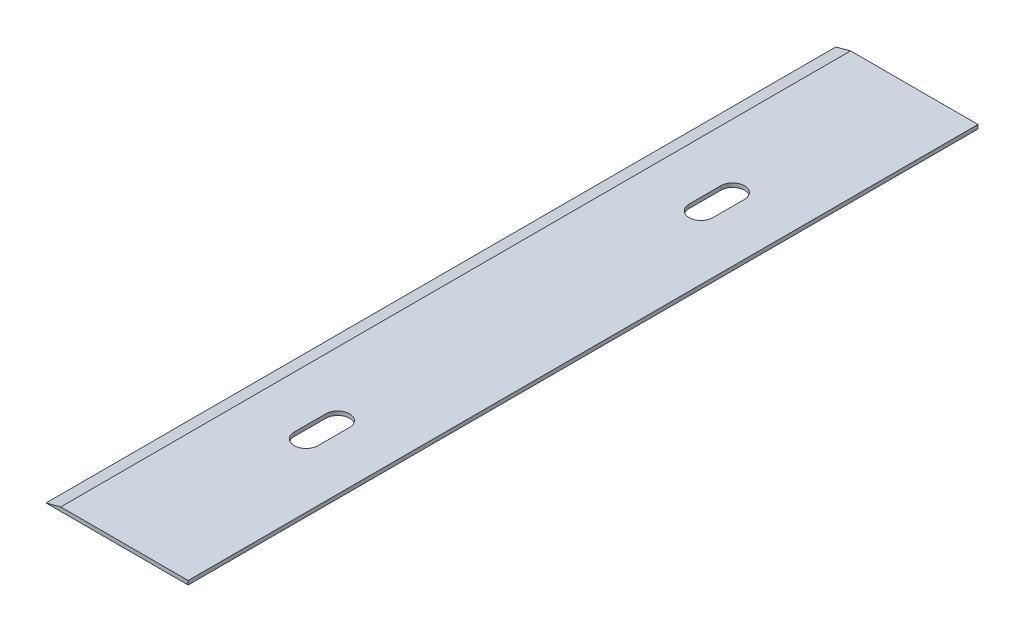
ISO-10303-21;
HEADER;
FILE_DESCRIPTION(('STEP AP214'),'2;1');
FILE_NAME('part.step','',(''),(''),'','','');
FILE_SCHEMA(('AUTOMOTIVE_DESIGN { 1 0 10303 214 1 1 1 1 }'));
ENDSEC;
DATA;
#1=APPLICATION_CONTEXT('core data for automotive mechanical design processes');
#2=APPLICATION_PROTOCOL_DEFINITION('international standard','automotive_design',2000,#1);
#3=PRODUCT_CONTEXT('',#1,'mechanical');
#4=PRODUCT('Part','Part','',(#3));
#5=PRODUCT_RELATED_PRODUCT_CATEGORY('part','',(#4));
#6=PRODUCT_DEFINITION_FORMATION('','',#4);
#7=PRODUCT_DEFINITION_CONTEXT('part definition',#1,'design');
#8=PRODUCT_DEFINITION('design','',#6,#7);
#9=PRODUCT_DEFINITION_SHAPE('','',#8);
#10=(LENGTH_UNIT() NAMED_UNIT(*) SI_UNIT(.MILLI.,.METRE.));
#11=(NAMED_UNIT(*) PLANE_ANGLE_UNIT() SI_UNIT($,.RADIAN.));
#12=(NAMED_UNIT(*) SI_UNIT($,.STERADIAN.) SOLID_ANGLE_UNIT());
#13=UNCERTAINTY_MEASURE_WITH_UNIT(LENGTH_MEASURE(1.E-05),#10,'distance_accuracy_value','');
#14=(GEOMETRIC_REPRESENTATION_CONTEXT(3) GLOBAL_UNCERTAINTY_ASSIGNED_CONTEXT((#13)) GLOBAL_UNIT_ASSIGNED_CONTEXT((#10,
#11,#12)) REPRESENTATION_CONTEXT('',''));
#15=CARTESIAN_POINT('',(0.,0.,0.));
#16=DIRECTION('',(0.,0.,1.));
#17=DIRECTION('',(1.,0.,0.));
#18=AXIS2_PLACEMENT_3D('',#15,#16,#17);
#19=CARTESIAN_POINT('',(18.,0.,-100.));
#20=DIRECTION('',(0.,-1.,0.));
#21=DIRECTION('',(1.,0.,0.));
#22=AXIS2_PLACEMENT_3D('',#19,#20,#21);
#23=PLANE('',#22);
#24=CARTESIAN_POINT('',(9.93301270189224,0.,-77.));
#25=DIRECTION('',(0.,1.,0.));
#26=DIRECTION('',(-1.,0.,0.));
#27=AXIS2_PLACEMENT_3D('',#24,#25,#26);
#28=CIRCLE('',#27,1.5);
#29=CARTESIAN_POINT('',(11.4330127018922,0.,-77.));
#30=VERTEX_POINT('',#29);
#31=CARTESIAN_POINT('',(8.43301270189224,0.,-77.));
#32=VERTEX_POINT('',#31);
#33=EDGE_CURVE('E183',#30,#32,#28,.T.);
#34=ORIENTED_EDGE('',*,*,#33,.T.);
#35=DIRECTION('',(0.,0.,1.));
#36=VECTOR('',#35,1.);
#37=CARTESIAN_POINT('',(8.43301270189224,0.,-77.));
#38=LINE('',#37,#36);
#39=CARTESIAN_POINT('',(8.43301270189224,0.,-73.));
#40=VERTEX_POINT('',#39);
#41=EDGE_CURVE('E187',#32,#40,#38,.T.);
#42=ORIENTED_EDGE('',*,*,#41,.T.);
#43=CARTESIAN_POINT('',(9.93301270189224,0.,-73.));
#44=DIRECTION('',(0.,1.,0.));
#45=DIRECTION('',(-1.,0.,0.));
#46=AXIS2_PLACEMENT_3D('',#43,#44,#45);
#47=CIRCLE('',#46,1.5);
#48=CARTESIAN_POINT('',(11.4330127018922,0.,-73.));
#49=VERTEX_POINT('',#48);
#50=EDGE_CURVE('E192',#40,#49,#47,.T.);
#51=ORIENTED_EDGE('',*,*,#50,.T.);
#52=DIRECTION('',(0.,0.,-1.));
#53=VECTOR('',#52,1.);
#54=CARTESIAN_POINT('',(11.4330127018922,0.,-77.));
#55=LINE('',#54,#53);
#56=EDGE_CURVE('E196',#49,#30,#55,.T.);
#57=ORIENTED_EDGE('',*,*,#56,.T.);
#58=EDGE_LOOP('',(#34,#42,#51,#57));
#59=FACE_BOUND('',#58,.T.);
#60=DIRECTION('',(1.,0.,0.));
#61=VECTOR('',#60,1.);
#62=CARTESIAN_POINT('',(18.,0.,0.));
#63=LINE('',#62,#61);
#64=CARTESIAN_POINT('',(0.,0.,0.));
#65=VERTEX_POINT('',#64);
#66=CARTESIAN_POINT('',(18.,0.,0.));
#67=VERTEX_POINT('',#66);
#68=EDGE_CURVE('E217',#65,#67,#63,.T.);
#69=ORIENTED_EDGE('',*,*,#68,.F.);
#70=DIRECTION('',(0.,0.,1.));
#71=VECTOR('',#70,1.);
#72=CARTESIAN_POINT('',(0.,0.,-100.));
#73=LINE('',#72,#71);
#74=CARTESIAN_POINT('',(0.,0.,-100.));
#75=VERTEX_POINT('',#74);
#76=EDGE_CURVE('E11',#75,#65,#73,.T.);
#77=ORIENTED_EDGE('',*,*,#76,.F.);
#78=DIRECTION('',(1.,0.,0.));
#79=VECTOR('',#78,1.);
#80=CARTESIAN_POINT('',(18.,0.,-100.));
#81=LINE('',#80,#79);
#82=CARTESIAN_POINT('',(18.,0.,-100.));
#83=VERTEX_POINT('',#82);
#84=EDGE_CURVE('E227',#75,#83,#81,.T.);
#85=ORIENTED_EDGE('',*,*,#84,.T.);
#86=DIRECTION('',(0.,0.,1.));
#87=VECTOR('',#86,1.);
#88=CARTESIAN_POINT('',(18.,0.,-100.));
#89=LINE('',#88,#87);
#90=EDGE_CURVE('E50',#83,#67,#89,.T.);
#91=ORIENTED_EDGE('',*,*,#90,.T.);
#92=EDGE_LOOP('',(#69,#77,#85,#91));
#93=FACE_BOUND('',#92,.T.);
#94=DIRECTION('',(0.,0.,-1.));
#95=VECTOR('',#94,1.);
#96=CARTESIAN_POINT('',(8.43301270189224,0.,-23.));
#97=LINE('',#96,#95);
#98=CARTESIAN_POINT('',(8.43301270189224,0.,-23.));
#99=VERTEX_POINT('',#98);
#100=CARTESIAN_POINT('',(8.43301270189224,0.,-27.));
#101=VERTEX_POINT('',#100);
#102=EDGE_CURVE('E151',#99,#101,#97,.T.);
#103=ORIENTED_EDGE('',*,*,#102,.F.);
#104=CARTESIAN_POINT('',(9.93301270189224,0.,-23.));
#105=DIRECTION('',(0.,-1.,0.));
#106=DIRECTION('',(-1.,0.,0.));
#107=AXIS2_PLACEMENT_3D('',#104,#105,#106);
#108=CIRCLE('',#107,1.5);
#109=CARTESIAN_POINT('',(11.4330127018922,0.,-23.));
#110=VERTEX_POINT('',#109);
#111=EDGE_CURVE('E146',#110,#99,#108,.T.);
#112=ORIENTED_EDGE('',*,*,#111,.F.);
#113=DIRECTION('',(0.,0.,1.));
#114=VECTOR('',#113,1.);
#115=CARTESIAN_POINT('',(11.4330127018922,0.,-23.));
#116=LINE('',#115,#114);
#117=CARTESIAN_POINT('',(11.4330127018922,0.,-27.));
#118=VERTEX_POINT('',#117);
#119=EDGE_CURVE('E137',#118,#110,#116,.T.);
#120=ORIENTED_EDGE('',*,*,#119,.F.);
#121=CARTESIAN_POINT('',(9.93301270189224,0.,-27.));
#122=DIRECTION('',(0.,-1.,0.));
#123=DIRECTION('',(-1.,0.,0.));
#124=AXIS2_PLACEMENT_3D('',#121,#122,#123);
#125=CIRCLE('',#124,1.5);
#126=EDGE_CURVE('E145',#101,#118,#125,.T.);
#127=ORIENTED_EDGE('',*,*,#126,.F.);
#128=EDGE_LOOP('',(#103,#112,#120,#127));
#129=FACE_BOUND('',#128,.T.);
#130=ADVANCED_FACE('F47',(#59,#93,#129),#23,.T.);
#131=CARTESIAN_POINT('',(1.86602540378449,0.5,-100.));
#132=DIRECTION('',(0.,1.,0.));
#133=DIRECTION('',(-1.,0.,0.));
#134=AXIS2_PLACEMENT_3D('',#131,#132,#133);
#135=PLANE('',#134);
#136=CARTESIAN_POINT('',(9.93301270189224,0.500000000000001,-77.));
#137=DIRECTION('',(0.,1.,0.));
#138=DIRECTION('',(-1.,0.,0.));
#139=AXIS2_PLACEMENT_3D('',#136,#137,#138);
#140=CIRCLE('',#139,1.5);
#141=CARTESIAN_POINT('',(11.4330127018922,0.500000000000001,-77.));
#142=VERTEX_POINT('',#141);
#143=CARTESIAN_POINT('',(8.43301270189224,0.500000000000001,-77.));
#144=VERTEX_POINT('',#143);
#145=EDGE_CURVE('E177',#142,#144,#140,.T.);
#146=ORIENTED_EDGE('',*,*,#145,.F.);
#147=DIRECTION('',(0.,0.,-1.));
#148=VECTOR('',#147,1.);
#149=CARTESIAN_POINT('',(11.4330127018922,0.500000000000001,-77.));
#150=LINE('',#149,#148);
#151=CARTESIAN_POINT('',(11.4330127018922,0.500000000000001,-73.));
#152=VERTEX_POINT('',#151);
#153=EDGE_CURVE('E188',#152,#142,#150,.T.);
#154=ORIENTED_EDGE('',*,*,#153,.F.);
#155=CARTESIAN_POINT('',(9.93301270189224,0.500000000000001,-73.));
#156=DIRECTION('',(0.,1.,0.));
#157=DIRECTION('',(-1.,0.,0.));
#158=AXIS2_PLACEMENT_3D('',#155,#156,#157);
#159=CIRCLE('',#158,1.5);
#160=CARTESIAN_POINT('',(8.43301270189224,0.500000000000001,-73.));
#161=VERTEX_POINT('',#160);
#162=EDGE_CURVE('E207',#161,#152,#159,.T.);
#163=ORIENTED_EDGE('',*,*,#162,.F.);
#164=DIRECTION('',(0.,0.,1.));
#165=VECTOR('',#164,1.);
#166=CARTESIAN_POINT('',(8.43301270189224,0.500000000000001,-77.));
#167=LINE('',#166,#165);
#168=EDGE_CURVE('E203',#144,#161,#167,.T.);
#169=ORIENTED_EDGE('',*,*,#168,.F.);
#170=EDGE_LOOP('',(#146,#154,#163,#169));
#171=FACE_BOUND('',#170,.T.);
#172=DIRECTION('',(-1.,0.,0.));
#173=VECTOR('',#172,1.);
#174=CARTESIAN_POINT('',(1.86602540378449,0.5,0.));
#175=LINE('',#174,#173);
#176=CARTESIAN_POINT('',(18.,0.500000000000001,0.));
#177=VERTEX_POINT('',#176);
#178=CARTESIAN_POINT('',(1.86602540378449,0.5,0.));
#179=VERTEX_POINT('',#178);
#180=EDGE_CURVE('E251',#177,#179,#175,.T.);
#181=ORIENTED_EDGE('',*,*,#180,.F.);
#182=DIRECTION('',(0.,0.,1.));
#183=VECTOR('',#182,1.);
#184=CARTESIAN_POINT('',(18.,0.500000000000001,-100.));
#185=LINE('',#184,#183);
#186=CARTESIAN_POINT('',(18.,0.500000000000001,-100.));
#187=VERTEX_POINT('',#186);
#188=EDGE_CURVE('E259',#187,#177,#185,.T.);
#189=ORIENTED_EDGE('',*,*,#188,.F.);
#190=DIRECTION('',(-1.,0.,0.));
#191=VECTOR('',#190,1.);
#192=CARTESIAN_POINT('',(1.86602540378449,0.5,-100.));
#193=LINE('',#192,#191);
#194=CARTESIAN_POINT('',(1.86602540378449,0.5,-100.));
#195=VERTEX_POINT('',#194);
#196=EDGE_CURVE('E236',#187,#195,#193,.T.);
#197=ORIENTED_EDGE('',*,*,#196,.T.);
#198=DIRECTION('',(0.,0.,1.));
#199=VECTOR('',#198,1.);
#200=CARTESIAN_POINT('',(1.86602540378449,0.5,-100.));
#201=LINE('',#200,#199);
#202=EDGE_CURVE('E56',#195,#179,#201,.T.);
#203=ORIENTED_EDGE('',*,*,#202,.T.);
#204=EDGE_LOOP('',(#181,#189,#197,#203));
#205=FACE_BOUND('',#204,.T.);
#206=DIRECTION('',(0.,0.,1.));
#207=VECTOR('',#206,1.);
#208=CARTESIAN_POINT('',(11.4330127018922,0.500000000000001,-23.));
#209=LINE('',#208,#207);
#210=CARTESIAN_POINT('',(11.4330127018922,0.500000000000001,-27.));
#211=VERTEX_POINT('',#210);
#212=CARTESIAN_POINT('',(11.4330127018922,0.500000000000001,-23.));
#213=VERTEX_POINT('',#212);
#214=EDGE_CURVE('E168',#211,#213,#209,.T.);
#215=ORIENTED_EDGE('',*,*,#214,.T.);
#216=CARTESIAN_POINT('',(9.93301270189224,0.500000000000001,-23.));
#217=DIRECTION('',(0.,-1.,0.));
#218=DIRECTION('',(-1.,0.,0.));
#219=AXIS2_PLACEMENT_3D('',#216,#217,#218);
#220=CIRCLE('',#219,1.5);
#221=CARTESIAN_POINT('',(8.43301270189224,0.500000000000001,-23.));
#222=VERTEX_POINT('',#221);
#223=EDGE_CURVE('E72',#213,#222,#220,.T.);
#224=ORIENTED_EDGE('',*,*,#223,.T.);
#225=DIRECTION('',(0.,0.,-1.));
#226=VECTOR('',#225,1.);
#227=CARTESIAN_POINT('',(8.43301270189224,0.500000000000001,-23.));
#228=LINE('',#227,#226);
#229=CARTESIAN_POINT('',(8.43301270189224,0.500000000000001,-27.));
#230=VERTEX_POINT('',#229);
#231=EDGE_CURVE('E155',#222,#230,#228,.T.);
#232=ORIENTED_EDGE('',*,*,#231,.T.);
#233=CARTESIAN_POINT('',(9.93301270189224,0.500000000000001,-27.));
#234=DIRECTION('',(0.,-1.,0.));
#235=DIRECTION('',(-1.,0.,0.));
#236=AXIS2_PLACEMENT_3D('',#233,#234,#235);
#237=CIRCLE('',#236,1.5);
#238=EDGE_CURVE('E159',#230,#211,#237,.T.);
#239=ORIENTED_EDGE('',*,*,#238,.T.);
#240=EDGE_LOOP('',(#215,#224,#232,#239));
#241=FACE_BOUND('',#240,.T.);
#242=ADVANCED_FACE('F280',(#171,#205,#241),#135,.T.);
#243=CARTESIAN_POINT('',(0.,0.,-100.));
#244=DIRECTION('',(-0.258819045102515,0.96592582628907,0.));
#245=DIRECTION('',(-0.96592582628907,-0.258819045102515,0.));
#246=AXIS2_PLACEMENT_3D('',#243,#244,#245);
#247=PLANE('',#246);
#248=DIRECTION('',(-0.96592582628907,-0.258819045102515,0.));
#249=VECTOR('',#248,1.);
#250=CARTESIAN_POINT('',(0.,0.,0.));
#251=LINE('',#250,#249);
#252=EDGE_CURVE('E232',#179,#65,#251,.T.);
#253=ORIENTED_EDGE('',*,*,#252,.F.);
#254=ORIENTED_EDGE('',*,*,#202,.F.);
#255=DIRECTION('',(-0.96592582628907,-0.258819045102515,0.));
#256=VECTOR('',#255,1.);
#257=CARTESIAN_POINT('',(0.,0.,-100.));
#258=LINE('',#257,#256);
#259=EDGE_CURVE('E240',#195,#75,#258,.T.);
#260=ORIENTED_EDGE('',*,*,#259,.T.);
#261=ORIENTED_EDGE('',*,*,#76,.T.);
#262=EDGE_LOOP('',(#253,#254,#260,#261));
#263=FACE_BOUND('',#262,.T.);
#264=ADVANCED_FACE('F274',(#263),#247,.T.);
#265=CARTESIAN_POINT('',(18.,0.500000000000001,-100.));
#266=DIRECTION('',(1.,0.,0.));
#267=DIRECTION('',(0.,0.,-1.));
#268=AXIS2_PLACEMENT_3D('',#265,#266,#267);
#269=PLANE('',#268);
#270=DIRECTION('',(0.,1.,0.));
#271=VECTOR('',#270,1.);
#272=CARTESIAN_POINT('',(18.,0.500000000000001,0.));
#273=LINE('',#272,#271);
#274=EDGE_CURVE('E247',#67,#177,#273,.T.);
#275=ORIENTED_EDGE('',*,*,#274,.F.);
#276=ORIENTED_EDGE('',*,*,#90,.F.);
#277=DIRECTION('',(0.,1.,0.));
#278=VECTOR('',#277,1.);
#279=CARTESIAN_POINT('',(18.,0.500000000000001,-100.));
#280=LINE('',#279,#278);
#281=EDGE_CURVE('E231',#83,#187,#280,.T.);
#282=ORIENTED_EDGE('',*,*,#281,.T.);
#283=ORIENTED_EDGE('',*,*,#188,.T.);
#284=EDGE_LOOP('',(#275,#276,#282,#283));
#285=FACE_BOUND('',#284,.T.);
#286=ADVANCED_FACE('F269',(#285),#269,.T.);
#287=CARTESIAN_POINT('',(0.,0.,-100.));
#288=DIRECTION('',(0.,0.,1.));
#289=DIRECTION('',(1.,0.,0.));
#290=AXIS2_PLACEMENT_3D('',#287,#288,#289);
#291=PLANE('',#290);
#292=ORIENTED_EDGE('',*,*,#84,.F.);
#293=ORIENTED_EDGE('',*,*,#259,.F.);
#294=ORIENTED_EDGE('',*,*,#196,.F.);
#295=ORIENTED_EDGE('',*,*,#281,.F.);
#296=EDGE_LOOP('',(#292,#293,#294,#295));
#297=FACE_BOUND('',#296,.T.);
#298=ADVANCED_FACE('F277',(#297),#291,.F.);
#299=CARTESIAN_POINT('',(0.,0.,0.));
#300=DIRECTION('',(0.,0.,1.));
#301=DIRECTION('',(1.,0.,0.));
#302=AXIS2_PLACEMENT_3D('',#299,#300,#301);
#303=PLANE('',#302);
#304=ORIENTED_EDGE('',*,*,#68,.T.);
#305=ORIENTED_EDGE('',*,*,#274,.T.);
#306=ORIENTED_EDGE('',*,*,#180,.T.);
#307=ORIENTED_EDGE('',*,*,#252,.T.);
#308=EDGE_LOOP('',(#304,#305,#306,#307));
#309=FACE_BOUND('',#308,.T.);
#310=ADVANCED_FACE('F271',(#309),#303,.T.);
#311=CARTESIAN_POINT('',(9.93301270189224,0.,-77.));
#312=DIRECTION('',(0.,1.,0.));
#313=DIRECTION('',(-1.,0.,0.));
#314=AXIS2_PLACEMENT_3D('',#311,#312,#313);
#315=CYLINDRICAL_SURFACE('',#314,1.5);
#316=ORIENTED_EDGE('',*,*,#145,.T.);
#317=DIRECTION('',(0.,1.,0.));
#318=VECTOR('',#317,1.);
#319=CARTESIAN_POINT('',(8.43301270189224,0.,-77.));
#320=LINE('',#319,#318);
#321=EDGE_CURVE('E200',#32,#144,#320,.T.);
#322=ORIENTED_EDGE('',*,*,#321,.F.);
#323=ORIENTED_EDGE('',*,*,#33,.F.);
#324=DIRECTION('',(0.,1.,0.));
#325=VECTOR('',#324,1.);
#326=CARTESIAN_POINT('',(11.4330127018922,0.,-77.));
#327=LINE('',#326,#325);
#328=EDGE_CURVE('E214',#30,#142,#327,.T.);
#329=ORIENTED_EDGE('',*,*,#328,.T.);
#330=EDGE_LOOP('',(#316,#322,#323,#329));
#331=FACE_BOUND('',#330,.T.);
#332=ADVANCED_FACE('F309',(#331),#315,.F.);
#333=CARTESIAN_POINT('',(11.4330127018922,0.,-77.));
#334=DIRECTION('',(1.,0.,0.));
#335=DIRECTION('',(0.,1.,0.));
#336=AXIS2_PLACEMENT_3D('',#333,#334,#335);
#337=PLANE('',#336);
#338=ORIENTED_EDGE('',*,*,#153,.T.);
#339=ORIENTED_EDGE('',*,*,#328,.F.);
#340=ORIENTED_EDGE('',*,*,#56,.F.);
#341=DIRECTION('',(0.,1.,0.));
#342=VECTOR('',#341,1.);
#343=CARTESIAN_POINT('',(11.4330127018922,0.,-73.));
#344=LINE('',#343,#342);
#345=EDGE_CURVE('E218',#49,#152,#344,.T.);
#346=ORIENTED_EDGE('',*,*,#345,.T.);
#347=EDGE_LOOP('',(#338,#339,#340,#346));
#348=FACE_BOUND('',#347,.T.);
#349=ADVANCED_FACE('F319',(#348),#337,.F.);
#350=CARTESIAN_POINT('',(9.93301270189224,0.,-73.));
#351=DIRECTION('',(0.,1.,0.));
#352=DIRECTION('',(-1.,0.,0.));
#353=AXIS2_PLACEMENT_3D('',#350,#351,#352);
#354=CYLINDRICAL_SURFACE('',#353,1.5);
#355=ORIENTED_EDGE('',*,*,#162,.T.);
#356=ORIENTED_EDGE('',*,*,#345,.F.);
#357=ORIENTED_EDGE('',*,*,#50,.F.);
#358=DIRECTION('',(0.,1.,0.));
#359=VECTOR('',#358,1.);
#360=CARTESIAN_POINT('',(8.43301270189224,0.,-73.));
#361=LINE('',#360,#359);
#362=EDGE_CURVE('E221',#40,#161,#361,.T.);
#363=ORIENTED_EDGE('',*,*,#362,.T.);
#364=EDGE_LOOP('',(#355,#356,#357,#363));
#365=FACE_BOUND('',#364,.T.);
#366=ADVANCED_FACE('F316',(#365),#354,.F.);
#367=CARTESIAN_POINT('',(8.43301270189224,0.,-77.));
#368=DIRECTION('',(-1.,0.,0.));
#369=DIRECTION('',(0.,-1.,0.));
#370=AXIS2_PLACEMENT_3D('',#367,#368,#369);
#371=PLANE('',#370);
#372=ORIENTED_EDGE('',*,*,#168,.T.);
#373=ORIENTED_EDGE('',*,*,#362,.F.);
#374=ORIENTED_EDGE('',*,*,#41,.F.);
#375=ORIENTED_EDGE('',*,*,#321,.T.);
#376=EDGE_LOOP('',(#372,#373,#374,#375));
#377=FACE_BOUND('',#376,.T.);
#378=ADVANCED_FACE('F298',(#377),#371,.F.);
#379=CARTESIAN_POINT('',(9.93301270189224,0.,-23.));
#380=DIRECTION('',(0.,1.,0.));
#381=DIRECTION('',(-1.,0.,0.));
#382=AXIS2_PLACEMENT_3D('',#379,#380,#381);
#383=CYLINDRICAL_SURFACE('',#382,1.5);
#384=ORIENTED_EDGE('',*,*,#223,.F.);
#385=DIRECTION('',(0.,1.,0.));
#386=VECTOR('',#385,1.);
#387=CARTESIAN_POINT('',(11.4330127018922,0.,-23.));
#388=LINE('',#387,#386);
#389=EDGE_CURVE('E139',#110,#213,#388,.T.);
#390=ORIENTED_EDGE('',*,*,#389,.F.);
#391=ORIENTED_EDGE('',*,*,#111,.T.);
#392=DIRECTION('',(0.,1.,0.));
#393=VECTOR('',#392,1.);
#394=CARTESIAN_POINT('',(8.43301270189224,0.,-23.));
#395=LINE('',#394,#393);
#396=EDGE_CURVE('E174',#99,#222,#395,.T.);
#397=ORIENTED_EDGE('',*,*,#396,.T.);
#398=EDGE_LOOP('',(#384,#390,#391,#397));
#399=FACE_BOUND('',#398,.T.);
#400=ADVANCED_FACE('F148',(#399),#383,.F.);
#401=CARTESIAN_POINT('',(8.43301270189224,0.,-23.));
#402=DIRECTION('',(1.,0.,0.));
#403=DIRECTION('',(0.,1.,0.));
#404=AXIS2_PLACEMENT_3D('',#401,#402,#403);
#405=PLANE('',#404);
#406=ORIENTED_EDGE('',*,*,#231,.F.);
#407=ORIENTED_EDGE('',*,*,#396,.F.);
#408=ORIENTED_EDGE('',*,*,#102,.T.);
#409=DIRECTION('',(0.,1.,0.));
#410=VECTOR('',#409,1.);
#411=CARTESIAN_POINT('',(8.43301270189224,0.,-27.));
#412=LINE('',#411,#410);
#413=EDGE_CURVE('E178',#101,#230,#412,.T.);
#414=ORIENTED_EDGE('',*,*,#413,.T.);
#415=EDGE_LOOP('',(#406,#407,#408,#414));
#416=FACE_BOUND('',#415,.T.);
#417=ADVANCED_FACE('F290',(#416),#405,.T.);
#418=CARTESIAN_POINT('',(9.93301270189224,0.,-27.));
#419=DIRECTION('',(0.,1.,0.));
#420=DIRECTION('',(-1.,0.,0.));
#421=AXIS2_PLACEMENT_3D('',#418,#419,#420);
#422=CYLINDRICAL_SURFACE('',#421,1.5);
#423=ORIENTED_EDGE('',*,*,#238,.F.);
#424=ORIENTED_EDGE('',*,*,#413,.F.);
#425=ORIENTED_EDGE('',*,*,#126,.T.);
#426=DIRECTION('',(0.,1.,0.));
#427=VECTOR('',#426,1.);
#428=CARTESIAN_POINT('',(11.4330127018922,0.,-27.));
#429=LINE('',#428,#427);
#430=EDGE_CURVE('E64',#118,#211,#429,.T.);
#431=ORIENTED_EDGE('',*,*,#430,.T.);
#432=EDGE_LOOP('',(#423,#424,#425,#431));
#433=FACE_BOUND('',#432,.T.);
#434=ADVANCED_FACE('F288',(#433),#422,.F.);
#435=CARTESIAN_POINT('',(11.4330127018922,0.,-23.));
#436=DIRECTION('',(-1.,0.,0.));
#437=DIRECTION('',(0.,-1.,0.));
#438=AXIS2_PLACEMENT_3D('',#435,#436,#437);
#439=PLANE('',#438);
#440=ORIENTED_EDGE('',*,*,#214,.F.);
#441=ORIENTED_EDGE('',*,*,#430,.F.);
#442=ORIENTED_EDGE('',*,*,#119,.T.);
#443=ORIENTED_EDGE('',*,*,#389,.T.);
#444=EDGE_LOOP('',(#440,#441,#442,#443));
#445=FACE_BOUND('',#444,.T.);
#446=ADVANCED_FACE('F138',(#445),#439,.T.);
#447=CLOSED_SHELL('',(#130,#242,#264,#286,#298,#310,#332,#349,#366,#378,#400,#417,#434,#446));
#448=MANIFOLD_SOLID_BREP('B2',#447);
#449=ADVANCED_BREP_SHAPE_REPRESENTATION('',(#18,#448),#14);
#450=SHAPE_DEFINITION_REPRESENTATION(#9,#449);
ENDSEC;
END-ISO-10303-21;
